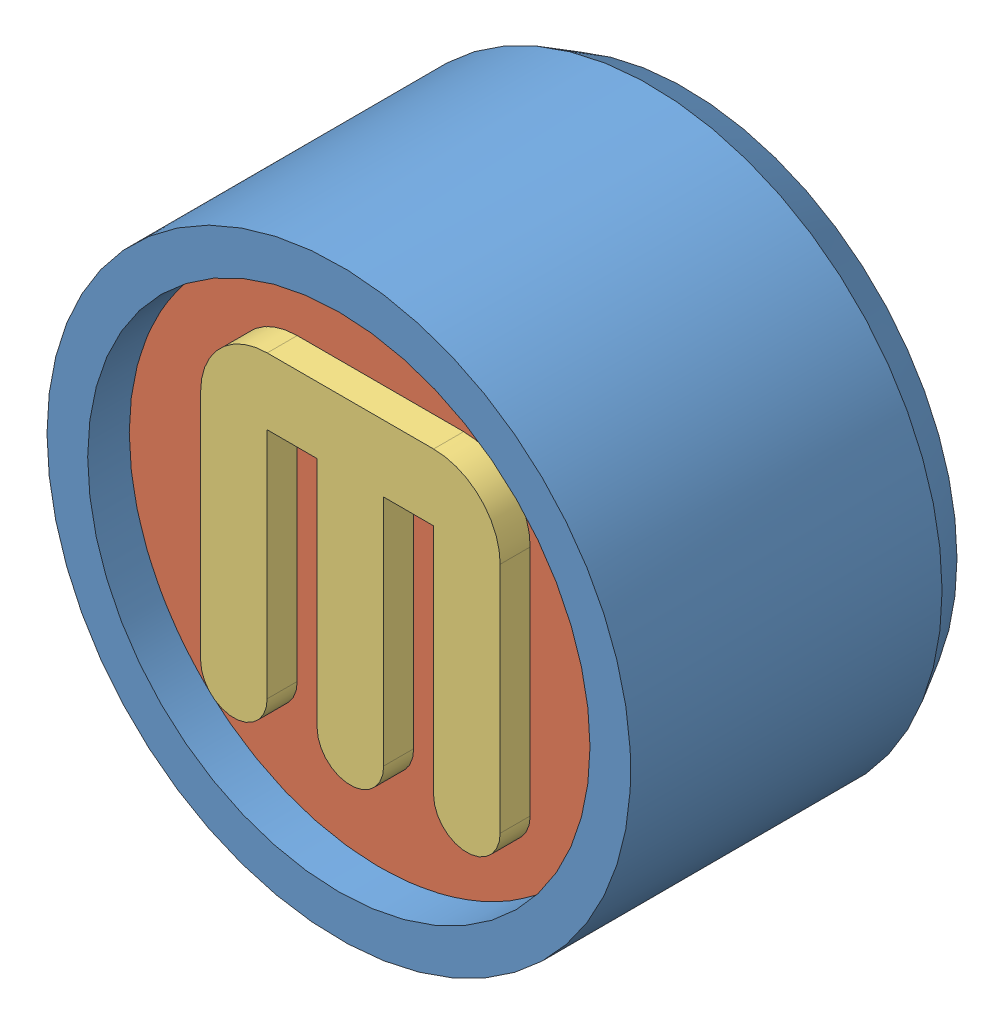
SolidWorks assembly torso.SLDASM, configuration Default (file format 4400). Lengths in mm.
Overall size (28.7 28.7 17.04).
3 component instances, 3 part files, 5 mates.
Components (placement in the parent):
- torso outside-1: torso outside.SLDPRT [Default] at (39.2578 11.915 -37.3325) size (28.7 28.7 17.04)
- torso insert-1: torso insert.SLDPRT [Default] at (39.2578 11.915 -25.3325) size (24.7 24.7 3.07)
- torso M insert-1: torso M insert.SLDPRT [Default] at (39.2578 11.915 -23.8564) size (14.73 16.36 3)
Mates (geometry in assembly coordinates):
- Concentric1: concentric aligned: cylinder of torso outside-1 through (39.2578 11.915 -20.2888) axis (0 0 -1) radius 12.35; cylinder of torso insert-1 through (39.2578 11.915 -22.3325) axis (0 0 -1) radius 12.35
- Coincident1: coincident anti-aligned: plane of torso insert-1 through (46.6215 5.4604 -22.3325) normal (-1 0 0); plane of torso M insert-1 through (46.6215 5.4604 -20.8564) normal (1 0 0)
- Coincident2: coincident anti-aligned: plane of torso insert-1 through (43.3487 20.1877 -22.3325) normal (0 -1 0); plane of torso M insert-1 through (43.3487 20.1877 -20.8564) normal (0 1 0)
- Coincident4: coincident anti-aligned: plane of torso outside-1 through (40.8578 25.765 -23.3325) normal (0 0 1); plane of torso insert-1 through (37.2578 22.265 -23.3325) normal (0 0 -1)
- Parallel1: parallel aligned: line of torso outside-1 through (40.8578 22.765 -23.3325) axis (-1 0 0); line of torso insert-1 through (41.2578 22.265 -24.6892) axis (-1 0 0)
